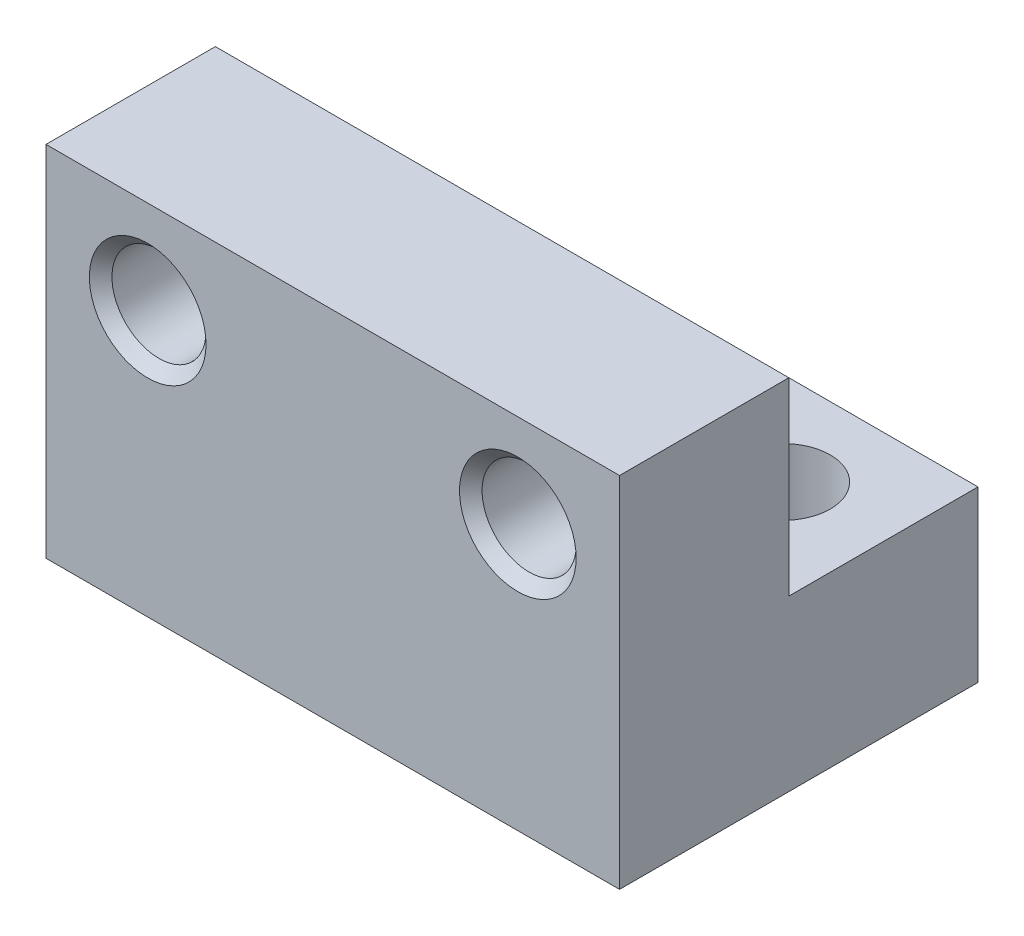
ISO-10303-21;
HEADER;
FILE_DESCRIPTION(('STEP AP214'),'2;1');
FILE_NAME('part.step','',(''),(''),'','','');
FILE_SCHEMA(('AUTOMOTIVE_DESIGN { 1 0 10303 214 1 1 1 1 }'));
ENDSEC;
DATA;
#1=APPLICATION_CONTEXT('core data for automotive mechanical design processes');
#2=APPLICATION_PROTOCOL_DEFINITION('international standard','automotive_design',2000,#1);
#3=PRODUCT_CONTEXT('',#1,'mechanical');
#4=PRODUCT('Part','Part','',(#3));
#5=PRODUCT_RELATED_PRODUCT_CATEGORY('part','',(#4));
#6=PRODUCT_DEFINITION_FORMATION('','',#4);
#7=PRODUCT_DEFINITION_CONTEXT('part definition',#1,'design');
#8=PRODUCT_DEFINITION('design','',#6,#7);
#9=PRODUCT_DEFINITION_SHAPE('','',#8);
#10=(LENGTH_UNIT() NAMED_UNIT(*) SI_UNIT(.MILLI.,.METRE.));
#11=(NAMED_UNIT(*) PLANE_ANGLE_UNIT() SI_UNIT($,.RADIAN.));
#12=(NAMED_UNIT(*) SI_UNIT($,.STERADIAN.) SOLID_ANGLE_UNIT());
#13=UNCERTAINTY_MEASURE_WITH_UNIT(LENGTH_MEASURE(1.E-05),#10,'distance_accuracy_value','');
#14=(GEOMETRIC_REPRESENTATION_CONTEXT(3) GLOBAL_UNCERTAINTY_ASSIGNED_CONTEXT((#13)) GLOBAL_UNIT_ASSIGNED_CONTEXT((#10,
#11,#12)) REPRESENTATION_CONTEXT('',''));
#15=CARTESIAN_POINT('',(0.,0.,0.));
#16=DIRECTION('',(0.,0.,1.));
#17=DIRECTION('',(1.,0.,0.));
#18=AXIS2_PLACEMENT_3D('',#15,#16,#17);
#19=CARTESIAN_POINT('',(15.24,0.,-15.3814213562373));
#20=DIRECTION('',(0.,-1.,0.));
#21=DIRECTION('',(0.,0.,-1.));
#22=AXIS2_PLACEMENT_3D('',#19,#20,#21);
#23=PLANE('',#22);
#24=CARTESIAN_POINT('',(2.7025,0.,-7.05));
#25=DIRECTION('',(0.,-1.,0.));
#26=DIRECTION('',(0.,0.,-1.));
#27=AXIS2_PLACEMENT_3D('',#24,#25,#26);
#28=CIRCLE('',#27,1.54999999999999);
#29=CARTESIAN_POINT('',(2.7025,0.,-8.59999999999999));
#30=VERTEX_POINT('',#29);
#31=EDGE_CURVE('E158',#30,#30,#28,.F.);
#32=ORIENTED_EDGE('',*,*,#31,.T.);
#33=EDGE_LOOP('',(#32));
#34=FACE_BOUND('',#33,.T.);
#35=CARTESIAN_POINT('',(12.5375,0.,-7.05));
#36=DIRECTION('',(0.,-1.,0.));
#37=DIRECTION('',(0.,0.,-1.));
#38=AXIS2_PLACEMENT_3D('',#35,#36,#37);
#39=CIRCLE('',#38,1.54999999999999);
#40=CARTESIAN_POINT('',(12.5375,0.,-8.59999999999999));
#41=VERTEX_POINT('',#40);
#42=EDGE_CURVE('E155',#41,#41,#39,.F.);
#43=ORIENTED_EDGE('',*,*,#42,.T.);
#44=EDGE_LOOP('',(#43));
#45=FACE_BOUND('',#44,.T.);
#46=DIRECTION('',(0.,0.,1.));
#47=VECTOR('',#46,1.);
#48=CARTESIAN_POINT('',(0.,0.,-15.3814213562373));
#49=LINE('',#48,#47);
#50=CARTESIAN_POINT('',(0.,0.,-9.525));
#51=VERTEX_POINT('',#50);
#52=CARTESIAN_POINT('',(0.,0.,0.));
#53=VERTEX_POINT('',#52);
#54=EDGE_CURVE('E123',#51,#53,#49,.T.);
#55=ORIENTED_EDGE('',*,*,#54,.F.);
#56=DIRECTION('',(-1.,0.,0.));
#57=VECTOR('',#56,1.);
#58=CARTESIAN_POINT('',(15.24,0.,-9.525));
#59=LINE('',#58,#57);
#60=CARTESIAN_POINT('',(15.24,0.,-9.525));
#61=VERTEX_POINT('',#60);
#62=EDGE_CURVE('E85',#61,#51,#59,.T.);
#63=ORIENTED_EDGE('',*,*,#62,.F.);
#64=DIRECTION('',(0.,0.,1.));
#65=VECTOR('',#64,1.);
#66=CARTESIAN_POINT('',(15.24,0.,-15.3814213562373));
#67=LINE('',#66,#65);
#68=CARTESIAN_POINT('',(15.24,0.,0.));
#69=VERTEX_POINT('',#68);
#70=EDGE_CURVE('E138',#61,#69,#67,.T.);
#71=ORIENTED_EDGE('',*,*,#70,.T.);
#72=DIRECTION('',(-1.,0.,0.));
#73=VECTOR('',#72,1.);
#74=CARTESIAN_POINT('',(15.24,0.,0.));
#75=LINE('',#74,#73);
#76=EDGE_CURVE('E56',#69,#53,#75,.T.);
#77=ORIENTED_EDGE('',*,*,#76,.T.);
#78=EDGE_LOOP('',(#55,#63,#71,#77));
#79=FACE_BOUND('',#78,.T.);
#80=ADVANCED_FACE('F39',(#34,#45,#79),#23,.T.);
#81=CARTESIAN_POINT('',(15.24,4.7625,-9.525));
#82=DIRECTION('',(0.,0.,-1.));
#83=DIRECTION('',(0.,1.,0.));
#84=AXIS2_PLACEMENT_3D('',#81,#82,#83);
#85=PLANE('',#84);
#86=DIRECTION('',(0.,-1.,0.));
#87=VECTOR('',#86,1.);
#88=CARTESIAN_POINT('',(0.,4.7625,-9.525));
#89=LINE('',#88,#87);
#90=CARTESIAN_POINT('',(0.,4.5,-9.525));
#91=VERTEX_POINT('',#90);
#92=EDGE_CURVE('E125',#91,#51,#89,.T.);
#93=ORIENTED_EDGE('',*,*,#92,.F.);
#94=DIRECTION('',(-1.,0.,0.));
#95=VECTOR('',#94,1.);
#96=CARTESIAN_POINT('',(15.24,4.5,-9.525));
#97=LINE('',#96,#95);
#98=CARTESIAN_POINT('',(15.24,4.5,-9.525));
#99=VERTEX_POINT('',#98);
#100=EDGE_CURVE('E142',#99,#91,#97,.T.);
#101=ORIENTED_EDGE('',*,*,#100,.F.);
#102=DIRECTION('',(0.,-1.,0.));
#103=VECTOR('',#102,1.);
#104=CARTESIAN_POINT('',(15.24,4.7625,-9.525));
#105=LINE('',#104,#103);
#106=EDGE_CURVE('E195',#99,#61,#105,.T.);
#107=ORIENTED_EDGE('',*,*,#106,.T.);
#108=ORIENTED_EDGE('',*,*,#62,.T.);
#109=EDGE_LOOP('',(#93,#101,#107,#108));
#110=FACE_BOUND('',#109,.T.);
#111=ADVANCED_FACE('F212',(#110),#85,.T.);
#112=CARTESIAN_POINT('',(15.24,4.5,-15.3814213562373));
#113=DIRECTION('',(0.,1.,0.));
#114=DIRECTION('',(0.,0.,1.));
#115=AXIS2_PLACEMENT_3D('',#112,#113,#114);
#116=PLANE('',#115);
#117=CARTESIAN_POINT('',(12.5375,4.5,-7.05));
#118=DIRECTION('',(0.,1.,0.));
#119=DIRECTION('',(0.,0.,1.));
#120=AXIS2_PLACEMENT_3D('',#117,#118,#119);
#121=CIRCLE('',#120,1.24999999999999);
#122=CARTESIAN_POINT('',(12.5375,4.5,-5.80000000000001));
#123=VERTEX_POINT('',#122);
#124=EDGE_CURVE('E150',#123,#123,#121,.T.);
#125=ORIENTED_EDGE('',*,*,#124,.F.);
#126=EDGE_LOOP('',(#125));
#127=FACE_BOUND('',#126,.T.);
#128=CARTESIAN_POINT('',(2.7025,4.5,-7.05));
#129=DIRECTION('',(0.,1.,0.));
#130=DIRECTION('',(0.,0.,1.));
#131=AXIS2_PLACEMENT_3D('',#128,#129,#130);
#132=CIRCLE('',#131,1.24999999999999);
#133=CARTESIAN_POINT('',(2.7025,4.5,-5.80000000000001));
#134=VERTEX_POINT('',#133);
#135=EDGE_CURVE('E146',#134,#134,#132,.T.);
#136=ORIENTED_EDGE('',*,*,#135,.F.);
#137=EDGE_LOOP('',(#136));
#138=FACE_BOUND('',#137,.T.);
#139=DIRECTION('',(0.,0.,-1.));
#140=VECTOR('',#139,1.);
#141=CARTESIAN_POINT('',(0.,4.5,-15.3814213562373));
#142=LINE('',#141,#140);
#143=CARTESIAN_POINT('',(0.,4.5,-4.5));
#144=VERTEX_POINT('',#143);
#145=EDGE_CURVE('E129',#144,#91,#142,.T.);
#146=ORIENTED_EDGE('',*,*,#145,.F.);
#147=DIRECTION('',(-1.,0.,0.));
#148=VECTOR('',#147,1.);
#149=CARTESIAN_POINT('',(15.24,4.5,-4.5));
#150=LINE('',#149,#148);
#151=CARTESIAN_POINT('',(15.24,4.5,-4.5));
#152=VERTEX_POINT('',#151);
#153=EDGE_CURVE('E105',#152,#144,#150,.T.);
#154=ORIENTED_EDGE('',*,*,#153,.F.);
#155=DIRECTION('',(0.,0.,-1.));
#156=VECTOR('',#155,1.);
#157=CARTESIAN_POINT('',(15.24,4.5,-15.3814213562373));
#158=LINE('',#157,#156);
#159=EDGE_CURVE('E115',#152,#99,#158,.T.);
#160=ORIENTED_EDGE('',*,*,#159,.T.);
#161=ORIENTED_EDGE('',*,*,#100,.T.);
#162=EDGE_LOOP('',(#146,#154,#160,#161));
#163=FACE_BOUND('',#162,.T.);
#164=ADVANCED_FACE('F199',(#127,#138,#163),#116,.T.);
#165=CARTESIAN_POINT('',(15.24,4.7625,-4.5));
#166=DIRECTION('',(0.,0.,-1.));
#167=DIRECTION('',(0.,1.,0.));
#168=AXIS2_PLACEMENT_3D('',#165,#166,#167);
#169=PLANE('',#168);
#170=CARTESIAN_POINT('',(2.7025,7.05,-4.5));
#171=DIRECTION('',(0.,0.,-1.));
#172=DIRECTION('',(0.,1.,0.));
#173=AXIS2_PLACEMENT_3D('',#170,#171,#172);
#174=CIRCLE('',#173,1.24999999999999);
#175=CARTESIAN_POINT('',(2.7025,8.29999999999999,-4.5));
#176=VERTEX_POINT('',#175);
#177=EDGE_CURVE('E149',#176,#176,#174,.T.);
#178=ORIENTED_EDGE('',*,*,#177,.F.);
#179=EDGE_LOOP('',(#178));
#180=FACE_BOUND('',#179,.T.);
#181=CARTESIAN_POINT('',(12.5375,7.05,-4.5));
#182=DIRECTION('',(0.,0.,-1.));
#183=DIRECTION('',(0.,1.,0.));
#184=AXIS2_PLACEMENT_3D('',#181,#182,#183);
#185=CIRCLE('',#184,1.24999999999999);
#186=CARTESIAN_POINT('',(12.5375,8.29999999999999,-4.5));
#187=VERTEX_POINT('',#186);
#188=EDGE_CURVE('E126',#187,#187,#185,.T.);
#189=ORIENTED_EDGE('',*,*,#188,.F.);
#190=EDGE_LOOP('',(#189));
#191=FACE_BOUND('',#190,.T.);
#192=DIRECTION('',(0.,-1.,0.));
#193=VECTOR('',#192,1.);
#194=CARTESIAN_POINT('',(0.,4.7625,-4.5));
#195=LINE('',#194,#193);
#196=CARTESIAN_POINT('',(0.,9.525,-4.5));
#197=VERTEX_POINT('',#196);
#198=EDGE_CURVE('E101',#197,#144,#195,.T.);
#199=ORIENTED_EDGE('',*,*,#198,.F.);
#200=DIRECTION('',(-1.,0.,0.));
#201=VECTOR('',#200,1.);
#202=CARTESIAN_POINT('',(15.24,9.525,-4.5));
#203=LINE('',#202,#201);
#204=CARTESIAN_POINT('',(15.24,9.525,-4.5));
#205=VERTEX_POINT('',#204);
#206=EDGE_CURVE('E96',#205,#197,#203,.T.);
#207=ORIENTED_EDGE('',*,*,#206,.F.);
#208=DIRECTION('',(0.,-1.,0.));
#209=VECTOR('',#208,1.);
#210=CARTESIAN_POINT('',(15.24,4.7625,-4.5));
#211=LINE('',#210,#209);
#212=EDGE_CURVE('E99',#205,#152,#211,.T.);
#213=ORIENTED_EDGE('',*,*,#212,.T.);
#214=ORIENTED_EDGE('',*,*,#153,.T.);
#215=EDGE_LOOP('',(#199,#207,#213,#214));
#216=FACE_BOUND('',#215,.T.);
#217=ADVANCED_FACE('F98',(#180,#191,#216),#169,.T.);
#218=CARTESIAN_POINT('',(15.24,9.525,-15.3814213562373));
#219=DIRECTION('',(0.,1.,0.));
#220=DIRECTION('',(0.,0.,1.));
#221=AXIS2_PLACEMENT_3D('',#218,#219,#220);
#222=PLANE('',#221);
#223=DIRECTION('',(0.,0.,-1.));
#224=VECTOR('',#223,1.);
#225=CARTESIAN_POINT('',(0.,9.525,-15.3814213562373));
#226=LINE('',#225,#224);
#227=CARTESIAN_POINT('',(0.,9.525,0.));
#228=VERTEX_POINT('',#227);
#229=EDGE_CURVE('E133',#228,#197,#226,.T.);
#230=ORIENTED_EDGE('',*,*,#229,.F.);
#231=DIRECTION('',(-1.,0.,0.));
#232=VECTOR('',#231,1.);
#233=CARTESIAN_POINT('',(15.24,9.525,0.));
#234=LINE('',#233,#232);
#235=CARTESIAN_POINT('',(15.24,9.525,0.));
#236=VERTEX_POINT('',#235);
#237=EDGE_CURVE('E76',#236,#228,#234,.T.);
#238=ORIENTED_EDGE('',*,*,#237,.F.);
#239=DIRECTION('',(0.,0.,-1.));
#240=VECTOR('',#239,1.);
#241=CARTESIAN_POINT('',(15.24,9.525,-15.3814213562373));
#242=LINE('',#241,#240);
#243=EDGE_CURVE('E112',#236,#205,#242,.T.);
#244=ORIENTED_EDGE('',*,*,#243,.T.);
#245=ORIENTED_EDGE('',*,*,#206,.T.);
#246=EDGE_LOOP('',(#230,#238,#244,#245));
#247=FACE_BOUND('',#246,.T.);
#248=ADVANCED_FACE('F117',(#247),#222,.T.);
#249=CARTESIAN_POINT('',(15.24,4.7625,0.));
#250=DIRECTION('',(0.,0.,1.));
#251=DIRECTION('',(1.,0.,0.));
#252=AXIS2_PLACEMENT_3D('',#249,#250,#251);
#253=PLANE('',#252);
#254=CARTESIAN_POINT('',(12.5375,7.05,0.));
#255=DIRECTION('',(0.,0.,1.));
#256=DIRECTION('',(1.,0.,0.));
#257=AXIS2_PLACEMENT_3D('',#254,#255,#256);
#258=CIRCLE('',#257,1.54999999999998);
#259=CARTESIAN_POINT('',(14.0875,7.05,0.));
#260=VERTEX_POINT('',#259);
#261=EDGE_CURVE('E48',#260,#260,#258,.F.);
#262=ORIENTED_EDGE('',*,*,#261,.T.);
#263=EDGE_LOOP('',(#262));
#264=FACE_BOUND('',#263,.T.);
#265=CARTESIAN_POINT('',(2.7025,7.05,0.));
#266=DIRECTION('',(0.,0.,1.));
#267=DIRECTION('',(1.,0.,0.));
#268=AXIS2_PLACEMENT_3D('',#265,#266,#267);
#269=CIRCLE('',#268,1.54999999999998);
#270=CARTESIAN_POINT('',(4.25249999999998,7.05,0.));
#271=VERTEX_POINT('',#270);
#272=EDGE_CURVE('E167',#271,#271,#269,.F.);
#273=ORIENTED_EDGE('',*,*,#272,.T.);
#274=EDGE_LOOP('',(#273));
#275=FACE_BOUND('',#274,.T.);
#276=DIRECTION('',(0.,1.,0.));
#277=VECTOR('',#276,1.);
#278=CARTESIAN_POINT('',(0.,4.7625,0.));
#279=LINE('',#278,#277);
#280=EDGE_CURVE('E135',#53,#228,#279,.T.);
#281=ORIENTED_EDGE('',*,*,#280,.F.);
#282=ORIENTED_EDGE('',*,*,#76,.F.);
#283=DIRECTION('',(0.,1.,0.));
#284=VECTOR('',#283,1.);
#285=CARTESIAN_POINT('',(15.24,4.7625,0.));
#286=LINE('',#285,#284);
#287=EDGE_CURVE('E118',#69,#236,#286,.T.);
#288=ORIENTED_EDGE('',*,*,#287,.T.);
#289=ORIENTED_EDGE('',*,*,#237,.T.);
#290=EDGE_LOOP('',(#281,#282,#288,#289));
#291=FACE_BOUND('',#290,.T.);
#292=ADVANCED_FACE('F172',(#264,#275,#291),#253,.T.);
#293=CARTESIAN_POINT('',(15.24,4.7625,-15.3814213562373));
#294=DIRECTION('',(1.,0.,0.));
#295=DIRECTION('',(0.,0.,-1.));
#296=AXIS2_PLACEMENT_3D('',#293,#294,#295);
#297=PLANE('',#296);
#298=ORIENTED_EDGE('',*,*,#70,.F.);
#299=ORIENTED_EDGE('',*,*,#106,.F.);
#300=ORIENTED_EDGE('',*,*,#159,.F.);
#301=ORIENTED_EDGE('',*,*,#212,.F.);
#302=ORIENTED_EDGE('',*,*,#243,.F.);
#303=ORIENTED_EDGE('',*,*,#287,.F.);
#304=EDGE_LOOP('',(#298,#299,#300,#301,#302,#303));
#305=FACE_BOUND('',#304,.T.);
#306=ADVANCED_FACE('F110',(#305),#297,.T.);
#307=CARTESIAN_POINT('',(0.,4.7625,-15.3814213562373));
#308=DIRECTION('',(1.,0.,0.));
#309=DIRECTION('',(0.,0.,-1.));
#310=AXIS2_PLACEMENT_3D('',#307,#308,#309);
#311=PLANE('',#310);
#312=ORIENTED_EDGE('',*,*,#54,.T.);
#313=ORIENTED_EDGE('',*,*,#280,.T.);
#314=ORIENTED_EDGE('',*,*,#229,.T.);
#315=ORIENTED_EDGE('',*,*,#198,.T.);
#316=ORIENTED_EDGE('',*,*,#145,.T.);
#317=ORIENTED_EDGE('',*,*,#92,.T.);
#318=EDGE_LOOP('',(#312,#313,#314,#315,#316,#317));
#319=FACE_BOUND('',#318,.T.);
#320=ADVANCED_FACE('F185',(#319),#311,.F.);
#321=CARTESIAN_POINT('',(12.5375,7.05,0.));
#322=DIRECTION('',(0.,0.,1.));
#323=DIRECTION('',(1.,0.,0.));
#324=AXIS2_PLACEMENT_3D('',#321,#322,#323);
#325=CYLINDRICAL_SURFACE('',#324,1.24999999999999);
#326=CARTESIAN_POINT('',(12.5375,7.05,-0.29999999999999));
#327=DIRECTION('',(0.,0.,1.));
#328=DIRECTION('',(1.,0.,0.));
#329=AXIS2_PLACEMENT_3D('',#326,#327,#328);
#330=CIRCLE('',#329,1.24999999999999);
#331=CARTESIAN_POINT('',(13.7875,7.05,-0.29999999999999));
#332=VERTEX_POINT('',#331);
#333=EDGE_CURVE('E164',#332,#332,#330,.T.);
#334=ORIENTED_EDGE('',*,*,#333,.T.);
#335=EDGE_LOOP('',(#334));
#336=FACE_BOUND('',#335,.T.);
#337=ORIENTED_EDGE('',*,*,#188,.T.);
#338=EDGE_LOOP('',(#337));
#339=FACE_BOUND('',#338,.T.);
#340=ADVANCED_FACE('F181',(#336,#339),#325,.F.);
#341=CARTESIAN_POINT('',(2.7025,7.05,0.));
#342=DIRECTION('',(0.,0.,1.));
#343=DIRECTION('',(1.,0.,0.));
#344=AXIS2_PLACEMENT_3D('',#341,#342,#343);
#345=CYLINDRICAL_SURFACE('',#344,1.24999999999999);
#346=CARTESIAN_POINT('',(2.7025,7.05,-0.29999999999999));
#347=DIRECTION('',(0.,0.,1.));
#348=DIRECTION('',(1.,0.,0.));
#349=AXIS2_PLACEMENT_3D('',#346,#347,#348);
#350=CIRCLE('',#349,1.24999999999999);
#351=CARTESIAN_POINT('',(3.95249999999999,7.05,-0.29999999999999));
#352=VERTEX_POINT('',#351);
#353=EDGE_CURVE('E11',#352,#352,#350,.T.);
#354=ORIENTED_EDGE('',*,*,#353,.T.);
#355=EDGE_LOOP('',(#354));
#356=FACE_BOUND('',#355,.T.);
#357=ORIENTED_EDGE('',*,*,#177,.T.);
#358=EDGE_LOOP('',(#357));
#359=FACE_BOUND('',#358,.T.);
#360=ADVANCED_FACE('F184',(#356,#359),#345,.F.);
#361=CARTESIAN_POINT('',(2.7025,0.,-7.05));
#362=DIRECTION('',(0.,-1.,0.));
#363=DIRECTION('',(0.,0.,-1.));
#364=AXIS2_PLACEMENT_3D('',#361,#362,#363);
#365=CYLINDRICAL_SURFACE('',#364,1.24999999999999);
#366=CARTESIAN_POINT('',(2.7025,0.29999999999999,-7.05));
#367=DIRECTION('',(0.,-1.,0.));
#368=DIRECTION('',(0.,0.,-1.));
#369=AXIS2_PLACEMENT_3D('',#366,#367,#368);
#370=CIRCLE('',#369,1.24999999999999);
#371=CARTESIAN_POINT('',(2.7025,0.29999999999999,-8.29999999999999));
#372=VERTEX_POINT('',#371);
#373=EDGE_CURVE('E145',#372,#372,#370,.T.);
#374=ORIENTED_EDGE('',*,*,#373,.T.);
#375=EDGE_LOOP('',(#374));
#376=FACE_BOUND('',#375,.T.);
#377=ORIENTED_EDGE('',*,*,#135,.T.);
#378=EDGE_LOOP('',(#377));
#379=FACE_BOUND('',#378,.T.);
#380=ADVANCED_FACE('F238',(#376,#379),#365,.F.);
#381=CARTESIAN_POINT('',(12.5375,0.,-7.05));
#382=DIRECTION('',(0.,-1.,0.));
#383=DIRECTION('',(0.,0.,-1.));
#384=AXIS2_PLACEMENT_3D('',#381,#382,#383);
#385=CYLINDRICAL_SURFACE('',#384,1.24999999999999);
#386=CARTESIAN_POINT('',(12.5375,0.29999999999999,-7.05));
#387=DIRECTION('',(0.,-1.,0.));
#388=DIRECTION('',(0.,0.,-1.));
#389=AXIS2_PLACEMENT_3D('',#386,#387,#388);
#390=CIRCLE('',#389,1.24999999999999);
#391=CARTESIAN_POINT('',(12.5375,0.29999999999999,-8.29999999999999));
#392=VERTEX_POINT('',#391);
#393=EDGE_CURVE('E161',#392,#392,#390,.T.);
#394=ORIENTED_EDGE('',*,*,#393,.T.);
#395=EDGE_LOOP('',(#394));
#396=FACE_BOUND('',#395,.T.);
#397=ORIENTED_EDGE('',*,*,#124,.T.);
#398=EDGE_LOOP('',(#397));
#399=FACE_BOUND('',#398,.T.);
#400=ADVANCED_FACE('F226',(#396,#399),#385,.F.);
#401=CARTESIAN_POINT('',(2.7025,0.29999999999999,-7.05));
#402=DIRECTION('',(0.,-1.,0.));
#403=DIRECTION('',(0.,0.,-1.));
#404=AXIS2_PLACEMENT_3D('',#401,#402,#403);
#405=CONICAL_SURFACE('',#404,1.24999999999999,0.785398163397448);
#406=ORIENTED_EDGE('',*,*,#31,.F.);
#407=EDGE_LOOP('',(#406));
#408=FACE_BOUND('',#407,.T.);
#409=ORIENTED_EDGE('',*,*,#373,.F.);
#410=EDGE_LOOP('',(#409));
#411=FACE_BOUND('',#410,.T.);
#412=ADVANCED_FACE('F223',(#408,#411),#405,.F.);
#413=CARTESIAN_POINT('',(12.5375,0.29999999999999,-7.05));
#414=DIRECTION('',(0.,-1.,0.));
#415=DIRECTION('',(0.,0.,-1.));
#416=AXIS2_PLACEMENT_3D('',#413,#414,#415);
#417=CONICAL_SURFACE('',#416,1.24999999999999,0.785398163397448);
#418=ORIENTED_EDGE('',*,*,#42,.F.);
#419=EDGE_LOOP('',(#418));
#420=FACE_BOUND('',#419,.T.);
#421=ORIENTED_EDGE('',*,*,#393,.F.);
#422=EDGE_LOOP('',(#421));
#423=FACE_BOUND('',#422,.T.);
#424=ADVANCED_FACE('F178',(#420,#423),#417,.F.);
#425=CARTESIAN_POINT('',(12.5375,7.05,-0.29999999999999));
#426=DIRECTION('',(0.,0.,1.));
#427=DIRECTION('',(1.,0.,0.));
#428=AXIS2_PLACEMENT_3D('',#425,#426,#427);
#429=CONICAL_SURFACE('',#428,1.24999999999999,0.785398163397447);
#430=ORIENTED_EDGE('',*,*,#261,.F.);
#431=EDGE_LOOP('',(#430));
#432=FACE_BOUND('',#431,.T.);
#433=ORIENTED_EDGE('',*,*,#333,.F.);
#434=EDGE_LOOP('',(#433));
#435=FACE_BOUND('',#434,.T.);
#436=ADVANCED_FACE('F175',(#432,#435),#429,.F.);
#437=CARTESIAN_POINT('',(2.7025,7.05,-0.29999999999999));
#438=DIRECTION('',(0.,0.,1.));
#439=DIRECTION('',(1.,0.,0.));
#440=AXIS2_PLACEMENT_3D('',#437,#438,#439);
#441=CONICAL_SURFACE('',#440,1.24999999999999,0.785398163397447);
#442=ORIENTED_EDGE('',*,*,#272,.F.);
#443=EDGE_LOOP('',(#442));
#444=FACE_BOUND('',#443,.T.);
#445=ORIENTED_EDGE('',*,*,#353,.F.);
#446=EDGE_LOOP('',(#445));
#447=FACE_BOUND('',#446,.T.);
#448=ADVANCED_FACE('F41',(#444,#447),#441,.F.);
#449=CLOSED_SHELL('',(#80,#111,#164,#217,#248,#292,#306,#320,#340,#360,#380,#400,#412,#424,#436,#448));
#450=MANIFOLD_SOLID_BREP('B2',#449);
#451=ADVANCED_BREP_SHAPE_REPRESENTATION('',(#18,#450),#14);
#452=SHAPE_DEFINITION_REPRESENTATION(#9,#451);
ENDSEC;
END-ISO-10303-21;
